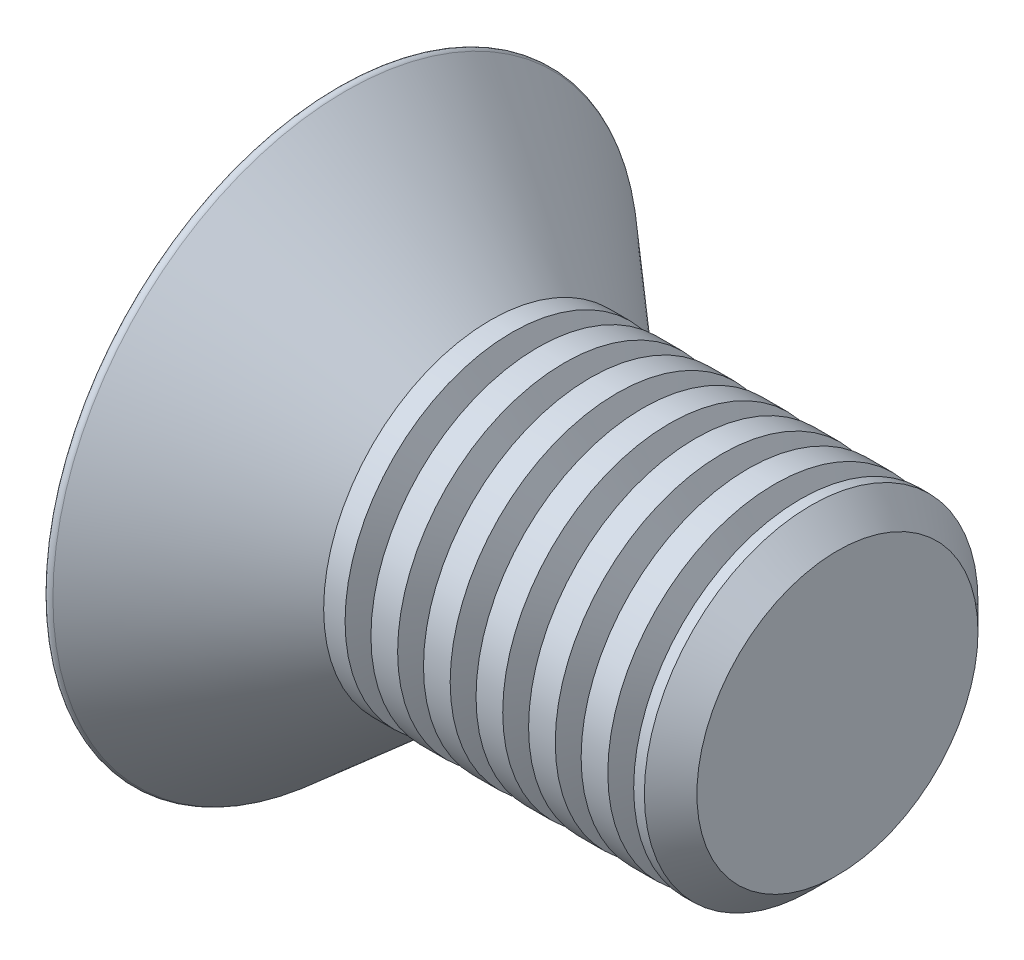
ISO-10303-21;
HEADER;
FILE_DESCRIPTION(('STEP AP214'),'2;1');
FILE_NAME('part.step','',(''),(''),'','','');
FILE_SCHEMA(('AUTOMOTIVE_DESIGN { 1 0 10303 214 1 1 1 1 }'));
ENDSEC;
DATA;
#1=APPLICATION_CONTEXT('core data for automotive mechanical design processes');
#2=APPLICATION_PROTOCOL_DEFINITION('international standard','automotive_design',2000,#1);
#3=PRODUCT_CONTEXT('',#1,'mechanical');
#4=PRODUCT('Part','Part','',(#3));
#5=PRODUCT_RELATED_PRODUCT_CATEGORY('part','',(#4));
#6=PRODUCT_DEFINITION_FORMATION('','',#4);
#7=PRODUCT_DEFINITION_CONTEXT('part definition',#1,'design');
#8=PRODUCT_DEFINITION('design','',#6,#7);
#9=PRODUCT_DEFINITION_SHAPE('','',#8);
#10=(LENGTH_UNIT() NAMED_UNIT(*) SI_UNIT(.MILLI.,.METRE.));
#11=(NAMED_UNIT(*) PLANE_ANGLE_UNIT() SI_UNIT($,.RADIAN.));
#12=(NAMED_UNIT(*) SI_UNIT($,.STERADIAN.) SOLID_ANGLE_UNIT());
#13=UNCERTAINTY_MEASURE_WITH_UNIT(LENGTH_MEASURE(1.E-05),#10,'distance_accuracy_value','');
#14=(GEOMETRIC_REPRESENTATION_CONTEXT(3) GLOBAL_UNCERTAINTY_ASSIGNED_CONTEXT((#13)) GLOBAL_UNIT_ASSIGNED_CONTEXT((#10,
#11,#12)) REPRESENTATION_CONTEXT('',''));
#15=CARTESIAN_POINT('',(0.,0.,0.));
#16=DIRECTION('',(0.,0.,1.));
#17=DIRECTION('',(1.,0.,0.));
#18=AXIS2_PLACEMENT_3D('',#15,#16,#17);
#19=CARTESIAN_POINT('',(-1.58750000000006,0.,0.));
#20=DIRECTION('',(-1.,0.,0.));
#21=DIRECTION('',(0.,0.,1.));
#22=AXIS2_PLACEMENT_3D('',#19,#20,#21);
#23=CYLINDRICAL_SURFACE('',#22,1.5875);
#24=CARTESIAN_POINT('',(-0.126532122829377,0.,0.));
#25=DIRECTION('',(-1.,0.,0.));
#26=DIRECTION('',(0.,0.,1.));
#27=AXIS2_PLACEMENT_3D('',#24,#25,#26);
#28=CIRCLE('',#27,1.5875);
#29=CARTESIAN_POINT('',(-0.126532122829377,0.,1.5875));
#30=VERTEX_POINT('',#29);
#31=EDGE_CURVE('E228',#30,#30,#28,.T.);
#32=ORIENTED_EDGE('',*,*,#31,.F.);
#33=EDGE_LOOP('',(#32));
#34=FACE_BOUND('',#33,.T.);
#35=CARTESIAN_POINT('',(0.0773169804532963,0.,0.));
#36=DIRECTION('',(-1.,0.,0.));
#37=DIRECTION('',(0.,0.,1.));
#38=AXIS2_PLACEMENT_3D('',#35,#36,#37);
#39=CIRCLE('',#38,1.5875);
#40=CARTESIAN_POINT('',(0.0773169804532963,0.,1.5875));
#41=VERTEX_POINT('',#40);
#42=EDGE_CURVE('E37',#41,#41,#39,.T.);
#43=ORIENTED_EDGE('',*,*,#42,.T.);
#44=EDGE_LOOP('',(#43));
#45=FACE_BOUND('',#44,.T.);
#46=ADVANCED_FACE('F33',(#34,#45),#23,.T.);
#47=CARTESIAN_POINT('',(-1.58750000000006,0.,0.));
#48=DIRECTION('',(-1.,0.,0.));
#49=DIRECTION('',(0.,0.,1.));
#50=AXIS2_PLACEMENT_3D('',#47,#48,#49);
#51=CONICAL_SURFACE('',#50,2.8575,0.715584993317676);
#52=CARTESIAN_POINT('',(-1.50469704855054,0.,0.));
#53=DIRECTION('',(1.,0.,0.));
#54=DIRECTION('',(0.,0.,-1.));
#55=AXIS2_PLACEMENT_3D('',#52,#53,#54);
#56=CIRCLE('',#55,2.78552049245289);
#57=CARTESIAN_POINT('',(-1.50469704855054,0.,-2.78552049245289));
#58=VERTEX_POINT('',#57);
#59=EDGE_CURVE('E248',#58,#58,#56,.T.);
#60=ORIENTED_EDGE('',*,*,#59,.T.);
#61=EDGE_LOOP('',(#60));
#62=FACE_BOUND('',#61,.T.);
#63=ORIENTED_EDGE('',*,*,#31,.T.);
#64=EDGE_LOOP('',(#63));
#65=FACE_BOUND('',#64,.T.);
#66=ADVANCED_FACE('F370',(#62,#65),#51,.T.);
#67=CARTESIAN_POINT('',(-1.58750000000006,-2.8575,0.));
#68=DIRECTION('',(-1.,0.,0.));
#69=DIRECTION('',(0.,0.,1.));
#70=AXIS2_PLACEMENT_3D('',#67,#68,#69);
#71=PLANE('',#70);
#72=DIRECTION('',(0.,0.,1.));
#73=VECTOR('',#72,1.);
#74=CARTESIAN_POINT('',(-1.58750000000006,-0.25,0.25));
#75=LINE('',#74,#73);
#76=CARTESIAN_POINT('',(-1.58750000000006,-0.25,0.75));
#77=VERTEX_POINT('',#76);
#78=CARTESIAN_POINT('',(-1.58750000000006,-0.25,1.85));
#79=VERTEX_POINT('',#78);
#80=EDGE_CURVE('E219',#77,#79,#75,.T.);
#81=ORIENTED_EDGE('',*,*,#80,.F.);
#82=CARTESIAN_POINT('',(-1.58750000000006,-0.75,0.75));
#83=DIRECTION('',(-1.,0.,0.));
#84=DIRECTION('',(0.,0.,1.));
#85=AXIS2_PLACEMENT_3D('',#82,#83,#84);
#86=CIRCLE('',#85,0.5);
#87=CARTESIAN_POINT('',(-1.58750000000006,-0.75,0.25));
#88=VERTEX_POINT('',#87);
#89=EDGE_CURVE('E260',#77,#88,#86,.T.);
#90=ORIENTED_EDGE('',*,*,#89,.T.);
#91=DIRECTION('',(0.,1.,0.));
#92=VECTOR('',#91,1.);
#93=CARTESIAN_POINT('',(-1.58750000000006,-1.85,0.25));
#94=LINE('',#93,#92);
#95=CARTESIAN_POINT('',(-1.58750000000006,-1.85,0.25));
#96=VERTEX_POINT('',#95);
#97=EDGE_CURVE('E216',#96,#88,#94,.T.);
#98=ORIENTED_EDGE('',*,*,#97,.F.);
#99=DIRECTION('',(0.,0.,1.));
#100=VECTOR('',#99,1.);
#101=CARTESIAN_POINT('',(-1.58750000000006,-1.85,-0.25));
#102=LINE('',#101,#100);
#103=CARTESIAN_POINT('',(-1.58750000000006,-1.85,-0.25));
#104=VERTEX_POINT('',#103);
#105=EDGE_CURVE('E213',#104,#96,#102,.T.);
#106=ORIENTED_EDGE('',*,*,#105,.F.);
#107=DIRECTION('',(0.,-1.,0.));
#108=VECTOR('',#107,1.);
#109=CARTESIAN_POINT('',(-1.58750000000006,-1.85,-0.25));
#110=LINE('',#109,#108);
#111=CARTESIAN_POINT('',(-1.58750000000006,-0.75,-0.25));
#112=VERTEX_POINT('',#111);
#113=EDGE_CURVE('E211',#112,#104,#110,.T.);
#114=ORIENTED_EDGE('',*,*,#113,.F.);
#115=CARTESIAN_POINT('',(-1.58750000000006,-0.75,-0.75));
#116=DIRECTION('',(-1.,0.,0.));
#117=DIRECTION('',(0.,0.,1.));
#118=AXIS2_PLACEMENT_3D('',#115,#116,#117);
#119=CIRCLE('',#118,0.5);
#120=CARTESIAN_POINT('',(-1.58750000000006,-0.25,-0.75));
#121=VERTEX_POINT('',#120);
#122=EDGE_CURVE('E258',#112,#121,#119,.T.);
#123=ORIENTED_EDGE('',*,*,#122,.T.);
#124=DIRECTION('',(0.,0.,1.));
#125=VECTOR('',#124,1.);
#126=CARTESIAN_POINT('',(-1.58750000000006,-0.25,-0.25));
#127=LINE('',#126,#125);
#128=CARTESIAN_POINT('',(-1.58750000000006,-0.25,-1.85));
#129=VERTEX_POINT('',#128);
#130=EDGE_CURVE('E208',#129,#121,#127,.T.);
#131=ORIENTED_EDGE('',*,*,#130,.F.);
#132=DIRECTION('',(0.,-1.,0.));
#133=VECTOR('',#132,1.);
#134=CARTESIAN_POINT('',(-1.58750000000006,0.25,-1.85));
#135=LINE('',#134,#133);
#136=CARTESIAN_POINT('',(-1.58750000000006,0.25,-1.85));
#137=VERTEX_POINT('',#136);
#138=EDGE_CURVE('E205',#137,#129,#135,.T.);
#139=ORIENTED_EDGE('',*,*,#138,.F.);
#140=DIRECTION('',(0.,0.,-1.));
#141=VECTOR('',#140,1.);
#142=CARTESIAN_POINT('',(-1.58750000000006,0.25,-0.25));
#143=LINE('',#142,#141);
#144=CARTESIAN_POINT('',(-1.58750000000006,0.25,-0.75));
#145=VERTEX_POINT('',#144);
#146=EDGE_CURVE('E203',#145,#137,#143,.T.);
#147=ORIENTED_EDGE('',*,*,#146,.F.);
#148=CARTESIAN_POINT('',(-1.58750000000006,0.75,-0.75));
#149=DIRECTION('',(-1.,0.,0.));
#150=DIRECTION('',(0.,0.,1.));
#151=AXIS2_PLACEMENT_3D('',#148,#149,#150);
#152=CIRCLE('',#151,0.5);
#153=CARTESIAN_POINT('',(-1.58750000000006,0.75,-0.25));
#154=VERTEX_POINT('',#153);
#155=EDGE_CURVE('E254',#145,#154,#152,.T.);
#156=ORIENTED_EDGE('',*,*,#155,.T.);
#157=DIRECTION('',(0.,-1.,0.));
#158=VECTOR('',#157,1.);
#159=CARTESIAN_POINT('',(-1.58750000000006,1.85,-0.25));
#160=LINE('',#159,#158);
#161=CARTESIAN_POINT('',(-1.58750000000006,1.85,-0.25));
#162=VERTEX_POINT('',#161);
#163=EDGE_CURVE('E201',#162,#154,#160,.T.);
#164=ORIENTED_EDGE('',*,*,#163,.F.);
#165=DIRECTION('',(0.,0.,-1.));
#166=VECTOR('',#165,1.);
#167=CARTESIAN_POINT('',(-1.58750000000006,1.85,0.25));
#168=LINE('',#167,#166);
#169=CARTESIAN_POINT('',(-1.58750000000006,1.85,0.25));
#170=VERTEX_POINT('',#169);
#171=EDGE_CURVE('E156',#170,#162,#168,.T.);
#172=ORIENTED_EDGE('',*,*,#171,.F.);
#173=DIRECTION('',(0.,1.,0.));
#174=VECTOR('',#173,1.);
#175=CARTESIAN_POINT('',(-1.58750000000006,1.85,0.25));
#176=LINE('',#175,#174);
#177=CARTESIAN_POINT('',(-1.58750000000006,0.75,0.25));
#178=VERTEX_POINT('',#177);
#179=EDGE_CURVE('E168',#178,#170,#176,.T.);
#180=ORIENTED_EDGE('',*,*,#179,.F.);
#181=CARTESIAN_POINT('',(-1.58750000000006,0.75,0.75));
#182=DIRECTION('',(-1.,0.,0.));
#183=DIRECTION('',(0.,0.,1.));
#184=AXIS2_PLACEMENT_3D('',#181,#182,#183);
#185=CIRCLE('',#184,0.5);
#186=CARTESIAN_POINT('',(-1.58750000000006,0.25,0.75));
#187=VERTEX_POINT('',#186);
#188=EDGE_CURVE('E256',#178,#187,#185,.T.);
#189=ORIENTED_EDGE('',*,*,#188,.T.);
#190=DIRECTION('',(0.,0.,-1.));
#191=VECTOR('',#190,1.);
#192=CARTESIAN_POINT('',(-1.58750000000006,0.25,0.25));
#193=LINE('',#192,#191);
#194=CARTESIAN_POINT('',(-1.58750000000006,0.25,1.85));
#195=VERTEX_POINT('',#194);
#196=EDGE_CURVE('E170',#195,#187,#193,.T.);
#197=ORIENTED_EDGE('',*,*,#196,.F.);
#198=DIRECTION('',(0.,1.,0.));
#199=VECTOR('',#198,1.);
#200=CARTESIAN_POINT('',(-1.58750000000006,-0.25,1.85));
#201=LINE('',#200,#199);
#202=EDGE_CURVE('E221',#79,#195,#201,.T.);
#203=ORIENTED_EDGE('',*,*,#202,.F.);
#204=EDGE_LOOP('',(#81,#90,#98,#106,#114,#123,#131,#139,#147,#156,#164,#172,#180,#189,#197,#203));
#205=FACE_BOUND('',#204,.T.);
#206=CARTESIAN_POINT('',(-1.58750000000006,0.,0.));
#207=DIRECTION('',(-1.,0.,0.));
#208=DIRECTION('',(0.,0.,1.));
#209=AXIS2_PLACEMENT_3D('',#206,#207,#208);
#210=CIRCLE('',#209,2.74778501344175);
#211=CARTESIAN_POINT('',(-1.58750000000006,0.,2.74778501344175));
#212=VERTEX_POINT('',#211);
#213=EDGE_CURVE('E245',#212,#212,#210,.T.);
#214=ORIENTED_EDGE('',*,*,#213,.T.);
#215=EDGE_LOOP('',(#214));
#216=FACE_BOUND('',#215,.T.);
#217=ADVANCED_FACE('F379',(#205,#216),#71,.T.);
#218=CARTESIAN_POINT('',(-1.53750000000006,0.,0.));
#219=DIRECTION('',(-1.,0.,0.));
#220=DIRECTION('',(0.,0.,1.));
#221=AXIS2_PLACEMENT_3D('',#218,#219,#220);
#222=TOROIDAL_SURFACE('',#221,2.74778501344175,0.05);
#223=ORIENTED_EDGE('',*,*,#59,.F.);
#224=EDGE_LOOP('',(#223));
#225=FACE_BOUND('',#224,.T.);
#226=ORIENTED_EDGE('',*,*,#213,.F.);
#227=EDGE_LOOP('',(#226));
#228=FACE_BOUND('',#227,.T.);
#229=ADVANCED_FACE('F711',(#225,#228),#222,.T.);
#230=CARTESIAN_POINT('',(-1.08750000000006,1.85,0.25));
#231=DIRECTION('',(0.,1.,0.));
#232=DIRECTION('',(0.,0.,1.));
#233=AXIS2_PLACEMENT_3D('',#230,#231,#232);
#234=PLANE('',#233);
#235=ORIENTED_EDGE('',*,*,#171,.T.);
#236=DIRECTION('',(-1.,0.,0.));
#237=VECTOR('',#236,1.);
#238=CARTESIAN_POINT('',(-1.08750000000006,1.85,-0.25));
#239=LINE('',#238,#237);
#240=CARTESIAN_POINT('',(-1.08750000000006,1.85,-0.25));
#241=VERTEX_POINT('',#240);
#242=EDGE_CURVE('E150',#241,#162,#239,.T.);
#243=ORIENTED_EDGE('',*,*,#242,.F.);
#244=DIRECTION('',(0.,0.,-1.));
#245=VECTOR('',#244,1.);
#246=CARTESIAN_POINT('',(-1.08750000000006,1.85,0.25));
#247=LINE('',#246,#245);
#248=CARTESIAN_POINT('',(-1.08750000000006,1.85,0.25));
#249=VERTEX_POINT('',#248);
#250=EDGE_CURVE('E154',#249,#241,#247,.T.);
#251=ORIENTED_EDGE('',*,*,#250,.F.);
#252=DIRECTION('',(-1.,0.,0.));
#253=VECTOR('',#252,1.);
#254=CARTESIAN_POINT('',(-1.08750000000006,1.85,0.25));
#255=LINE('',#254,#253);
#256=EDGE_CURVE('E226',#249,#170,#255,.T.);
#257=ORIENTED_EDGE('',*,*,#256,.T.);
#258=EDGE_LOOP('',(#235,#243,#251,#257));
#259=FACE_BOUND('',#258,.T.);
#260=ADVANCED_FACE('F151',(#259),#234,.F.);
#261=CARTESIAN_POINT('',(-1.08750000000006,1.85,0.25));
#262=DIRECTION('',(0.,0.,1.));
#263=DIRECTION('',(0.,-1.,0.));
#264=AXIS2_PLACEMENT_3D('',#261,#262,#263);
#265=PLANE('',#264);
#266=DIRECTION('',(0.,1.,0.));
#267=VECTOR('',#266,1.);
#268=CARTESIAN_POINT('',(-1.08750000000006,1.85,0.25));
#269=LINE('',#268,#267);
#270=CARTESIAN_POINT('',(-1.08750000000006,0.75,0.25));
#271=VERTEX_POINT('',#270);
#272=EDGE_CURVE('E159',#271,#249,#269,.T.);
#273=ORIENTED_EDGE('',*,*,#272,.F.);
#274=DIRECTION('',(-1.,0.,0.));
#275=VECTOR('',#274,1.);
#276=CARTESIAN_POINT('',(-1.08750000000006,0.75,0.25));
#277=LINE('',#276,#275);
#278=EDGE_CURVE('E269',#271,#178,#277,.T.);
#279=ORIENTED_EDGE('',*,*,#278,.T.);
#280=ORIENTED_EDGE('',*,*,#179,.T.);
#281=ORIENTED_EDGE('',*,*,#256,.F.);
#282=EDGE_LOOP('',(#273,#279,#280,#281));
#283=FACE_BOUND('',#282,.T.);
#284=ADVANCED_FACE('F695',(#283),#265,.F.);
#285=CARTESIAN_POINT('',(-1.08750000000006,0.25,0.25));
#286=DIRECTION('',(0.,1.,0.));
#287=DIRECTION('',(0.,0.,1.));
#288=AXIS2_PLACEMENT_3D('',#285,#286,#287);
#289=PLANE('',#288);
#290=ORIENTED_EDGE('',*,*,#196,.T.);
#291=DIRECTION('',(-1.,0.,0.));
#292=VECTOR('',#291,1.);
#293=CARTESIAN_POINT('',(-1.08750000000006,0.25,0.75));
#294=LINE('',#293,#292);
#295=CARTESIAN_POINT('',(-1.08750000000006,0.25,0.75));
#296=VERTEX_POINT('',#295);
#297=EDGE_CURVE('E272',#187,#296,#294,.F.);
#298=ORIENTED_EDGE('',*,*,#297,.T.);
#299=DIRECTION('',(0.,0.,-1.));
#300=VECTOR('',#299,1.);
#301=CARTESIAN_POINT('',(-1.08750000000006,0.25,0.25));
#302=LINE('',#301,#300);
#303=CARTESIAN_POINT('',(-1.08750000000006,0.25,1.85));
#304=VERTEX_POINT('',#303);
#305=EDGE_CURVE('E196',#304,#296,#302,.T.);
#306=ORIENTED_EDGE('',*,*,#305,.F.);
#307=DIRECTION('',(-1.,0.,0.));
#308=VECTOR('',#307,1.);
#309=CARTESIAN_POINT('',(-1.08750000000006,0.25,1.85));
#310=LINE('',#309,#308);
#311=EDGE_CURVE('E229',#304,#195,#310,.T.);
#312=ORIENTED_EDGE('',*,*,#311,.T.);
#313=EDGE_LOOP('',(#290,#298,#306,#312));
#314=FACE_BOUND('',#313,.T.);
#315=ADVANCED_FACE('F686',(#314),#289,.F.);
#316=CARTESIAN_POINT('',(-1.08750000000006,-0.25,1.85));
#317=DIRECTION('',(0.,0.,1.));
#318=DIRECTION('',(1.,0.,0.));
#319=AXIS2_PLACEMENT_3D('',#316,#317,#318);
#320=PLANE('',#319);
#321=ORIENTED_EDGE('',*,*,#202,.T.);
#322=ORIENTED_EDGE('',*,*,#311,.F.);
#323=DIRECTION('',(0.,1.,0.));
#324=VECTOR('',#323,1.);
#325=CARTESIAN_POINT('',(-1.08750000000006,-0.25,1.85));
#326=LINE('',#325,#324);
#327=CARTESIAN_POINT('',(-1.08750000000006,-0.25,1.85));
#328=VERTEX_POINT('',#327);
#329=EDGE_CURVE('E193',#328,#304,#326,.T.);
#330=ORIENTED_EDGE('',*,*,#329,.F.);
#331=DIRECTION('',(-1.,0.,0.));
#332=VECTOR('',#331,1.);
#333=CARTESIAN_POINT('',(-1.08750000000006,-0.25,1.85));
#334=LINE('',#333,#332);
#335=EDGE_CURVE('E231',#328,#79,#334,.T.);
#336=ORIENTED_EDGE('',*,*,#335,.T.);
#337=EDGE_LOOP('',(#321,#322,#330,#336));
#338=FACE_BOUND('',#337,.T.);
#339=ADVANCED_FACE('F677',(#338),#320,.F.);
#340=CARTESIAN_POINT('',(-1.08750000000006,-0.25,0.25));
#341=DIRECTION('',(0.,-1.,0.));
#342=DIRECTION('',(0.,0.,-1.));
#343=AXIS2_PLACEMENT_3D('',#340,#341,#342);
#344=PLANE('',#343);
#345=DIRECTION('',(0.,0.,1.));
#346=VECTOR('',#345,1.);
#347=CARTESIAN_POINT('',(-1.08750000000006,-0.25,0.25));
#348=LINE('',#347,#346);
#349=CARTESIAN_POINT('',(-1.08750000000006,-0.25,0.75));
#350=VERTEX_POINT('',#349);
#351=EDGE_CURVE('E191',#350,#328,#348,.T.);
#352=ORIENTED_EDGE('',*,*,#351,.F.);
#353=DIRECTION('',(-1.,0.,0.));
#354=VECTOR('',#353,1.);
#355=CARTESIAN_POINT('',(-1.08750000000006,-0.25,0.75));
#356=LINE('',#355,#354);
#357=EDGE_CURVE('E251',#350,#77,#356,.T.);
#358=ORIENTED_EDGE('',*,*,#357,.T.);
#359=ORIENTED_EDGE('',*,*,#80,.T.);
#360=ORIENTED_EDGE('',*,*,#335,.F.);
#361=EDGE_LOOP('',(#352,#358,#359,#360));
#362=FACE_BOUND('',#361,.T.);
#363=ADVANCED_FACE('F668',(#362),#344,.F.);
#364=CARTESIAN_POINT('',(-1.08750000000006,-1.85,0.25));
#365=DIRECTION('',(0.,0.,1.));
#366=DIRECTION('',(0.,-1.,0.));
#367=AXIS2_PLACEMENT_3D('',#364,#365,#366);
#368=PLANE('',#367);
#369=ORIENTED_EDGE('',*,*,#97,.T.);
#370=DIRECTION('',(-1.,0.,0.));
#371=VECTOR('',#370,1.);
#372=CARTESIAN_POINT('',(-1.08750000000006,-0.75,0.25));
#373=LINE('',#372,#371);
#374=CARTESIAN_POINT('',(-1.08750000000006,-0.75,0.25));
#375=VERTEX_POINT('',#374);
#376=EDGE_CURVE('E262',#88,#375,#373,.F.);
#377=ORIENTED_EDGE('',*,*,#376,.T.);
#378=DIRECTION('',(0.,1.,0.));
#379=VECTOR('',#378,1.);
#380=CARTESIAN_POINT('',(-1.08750000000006,-1.85,0.25));
#381=LINE('',#380,#379);
#382=CARTESIAN_POINT('',(-1.08750000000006,-1.85,0.25));
#383=VERTEX_POINT('',#382);
#384=EDGE_CURVE('E188',#383,#375,#381,.T.);
#385=ORIENTED_EDGE('',*,*,#384,.F.);
#386=DIRECTION('',(-1.,0.,0.));
#387=VECTOR('',#386,1.);
#388=CARTESIAN_POINT('',(-1.08750000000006,-1.85,0.25));
#389=LINE('',#388,#387);
#390=EDGE_CURVE('E234',#383,#96,#389,.T.);
#391=ORIENTED_EDGE('',*,*,#390,.T.);
#392=EDGE_LOOP('',(#369,#377,#385,#391));
#393=FACE_BOUND('',#392,.T.);
#394=ADVANCED_FACE('F659',(#393),#368,.F.);
#395=CARTESIAN_POINT('',(-1.08750000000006,-1.85,-0.25));
#396=DIRECTION('',(0.,-1.,0.));
#397=DIRECTION('',(0.,0.,-1.));
#398=AXIS2_PLACEMENT_3D('',#395,#396,#397);
#399=PLANE('',#398);
#400=ORIENTED_EDGE('',*,*,#105,.T.);
#401=ORIENTED_EDGE('',*,*,#390,.F.);
#402=DIRECTION('',(0.,0.,1.));
#403=VECTOR('',#402,1.);
#404=CARTESIAN_POINT('',(-1.08750000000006,-1.85,-0.25));
#405=LINE('',#404,#403);
#406=CARTESIAN_POINT('',(-1.08750000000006,-1.85,-0.25));
#407=VERTEX_POINT('',#406);
#408=EDGE_CURVE('E185',#407,#383,#405,.T.);
#409=ORIENTED_EDGE('',*,*,#408,.F.);
#410=DIRECTION('',(-1.,0.,0.));
#411=VECTOR('',#410,1.);
#412=CARTESIAN_POINT('',(-1.08750000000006,-1.85,-0.25));
#413=LINE('',#412,#411);
#414=EDGE_CURVE('E236',#407,#104,#413,.T.);
#415=ORIENTED_EDGE('',*,*,#414,.T.);
#416=EDGE_LOOP('',(#400,#401,#409,#415));
#417=FACE_BOUND('',#416,.T.);
#418=ADVANCED_FACE('F650',(#417),#399,.F.);
#419=CARTESIAN_POINT('',(-1.08750000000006,-1.85,-0.25));
#420=DIRECTION('',(0.,0.,-1.));
#421=DIRECTION('',(0.,1.,0.));
#422=AXIS2_PLACEMENT_3D('',#419,#420,#421);
#423=PLANE('',#422);
#424=DIRECTION('',(0.,-1.,0.));
#425=VECTOR('',#424,1.);
#426=CARTESIAN_POINT('',(-1.08750000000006,-1.85,-0.25));
#427=LINE('',#426,#425);
#428=CARTESIAN_POINT('',(-1.08750000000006,-0.75,-0.25));
#429=VERTEX_POINT('',#428);
#430=EDGE_CURVE('E183',#429,#407,#427,.T.);
#431=ORIENTED_EDGE('',*,*,#430,.F.);
#432=DIRECTION('',(-1.,0.,0.));
#433=VECTOR('',#432,1.);
#434=CARTESIAN_POINT('',(-1.08750000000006,-0.75,-0.25));
#435=LINE('',#434,#433);
#436=EDGE_CURVE('E264',#429,#112,#435,.T.);
#437=ORIENTED_EDGE('',*,*,#436,.T.);
#438=ORIENTED_EDGE('',*,*,#113,.T.);
#439=ORIENTED_EDGE('',*,*,#414,.F.);
#440=EDGE_LOOP('',(#431,#437,#438,#439));
#441=FACE_BOUND('',#440,.T.);
#442=ADVANCED_FACE('F641',(#441),#423,.F.);
#443=CARTESIAN_POINT('',(-1.08750000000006,-0.25,-0.25));
#444=DIRECTION('',(0.,-1.,0.));
#445=DIRECTION('',(0.,0.,-1.));
#446=AXIS2_PLACEMENT_3D('',#443,#444,#445);
#447=PLANE('',#446);
#448=ORIENTED_EDGE('',*,*,#130,.T.);
#449=DIRECTION('',(-1.,0.,0.));
#450=VECTOR('',#449,1.);
#451=CARTESIAN_POINT('',(-1.08750000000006,-0.25,-0.75));
#452=LINE('',#451,#450);
#453=CARTESIAN_POINT('',(-1.08750000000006,-0.25,-0.75));
#454=VERTEX_POINT('',#453);
#455=EDGE_CURVE('E267',#121,#454,#452,.F.);
#456=ORIENTED_EDGE('',*,*,#455,.T.);
#457=DIRECTION('',(0.,0.,1.));
#458=VECTOR('',#457,1.);
#459=CARTESIAN_POINT('',(-1.08750000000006,-0.25,-0.25));
#460=LINE('',#459,#458);
#461=CARTESIAN_POINT('',(-1.08750000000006,-0.25,-1.85));
#462=VERTEX_POINT('',#461);
#463=EDGE_CURVE('E180',#462,#454,#460,.T.);
#464=ORIENTED_EDGE('',*,*,#463,.F.);
#465=DIRECTION('',(-1.,0.,0.));
#466=VECTOR('',#465,1.);
#467=CARTESIAN_POINT('',(-1.08750000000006,-0.25,-1.85));
#468=LINE('',#467,#466);
#469=EDGE_CURVE('E239',#462,#129,#468,.T.);
#470=ORIENTED_EDGE('',*,*,#469,.T.);
#471=EDGE_LOOP('',(#448,#456,#464,#470));
#472=FACE_BOUND('',#471,.T.);
#473=ADVANCED_FACE('F631',(#472),#447,.F.);
#474=CARTESIAN_POINT('',(-1.08750000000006,0.25,-1.85));
#475=DIRECTION('',(0.,0.,-1.));
#476=DIRECTION('',(-1.,0.,0.));
#477=AXIS2_PLACEMENT_3D('',#474,#475,#476);
#478=PLANE('',#477);
#479=ORIENTED_EDGE('',*,*,#138,.T.);
#480=ORIENTED_EDGE('',*,*,#469,.F.);
#481=DIRECTION('',(0.,-1.,0.));
#482=VECTOR('',#481,1.);
#483=CARTESIAN_POINT('',(-1.08750000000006,0.25,-1.85));
#484=LINE('',#483,#482);
#485=CARTESIAN_POINT('',(-1.08750000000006,0.25,-1.85));
#486=VERTEX_POINT('',#485);
#487=EDGE_CURVE('E177',#486,#462,#484,.T.);
#488=ORIENTED_EDGE('',*,*,#487,.F.);
#489=DIRECTION('',(-1.,0.,0.));
#490=VECTOR('',#489,1.);
#491=CARTESIAN_POINT('',(-1.08750000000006,0.25,-1.85));
#492=LINE('',#491,#490);
#493=EDGE_CURVE('E158',#486,#137,#492,.T.);
#494=ORIENTED_EDGE('',*,*,#493,.T.);
#495=EDGE_LOOP('',(#479,#480,#488,#494));
#496=FACE_BOUND('',#495,.T.);
#497=ADVANCED_FACE('F621',(#496),#478,.F.);
#498=CARTESIAN_POINT('',(-1.08750000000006,0.25,-0.25));
#499=DIRECTION('',(0.,1.,0.));
#500=DIRECTION('',(0.,0.,1.));
#501=AXIS2_PLACEMENT_3D('',#498,#499,#500);
#502=PLANE('',#501);
#503=DIRECTION('',(0.,0.,-1.));
#504=VECTOR('',#503,1.);
#505=CARTESIAN_POINT('',(-1.08750000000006,0.25,-0.25));
#506=LINE('',#505,#504);
#507=CARTESIAN_POINT('',(-1.08750000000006,0.25,-0.75));
#508=VERTEX_POINT('',#507);
#509=EDGE_CURVE('E163',#508,#486,#506,.T.);
#510=ORIENTED_EDGE('',*,*,#509,.F.);
#511=DIRECTION('',(-1.,0.,0.));
#512=VECTOR('',#511,1.);
#513=CARTESIAN_POINT('',(-1.08750000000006,0.25,-0.75));
#514=LINE('',#513,#512);
#515=EDGE_CURVE('E274',#508,#145,#514,.T.);
#516=ORIENTED_EDGE('',*,*,#515,.T.);
#517=ORIENTED_EDGE('',*,*,#146,.T.);
#518=ORIENTED_EDGE('',*,*,#493,.F.);
#519=EDGE_LOOP('',(#510,#516,#517,#518));
#520=FACE_BOUND('',#519,.T.);
#521=ADVANCED_FACE('F613',(#520),#502,.F.);
#522=CARTESIAN_POINT('',(-1.08750000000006,1.85,-0.25));
#523=DIRECTION('',(0.,0.,-1.));
#524=DIRECTION('',(0.,1.,0.));
#525=AXIS2_PLACEMENT_3D('',#522,#523,#524);
#526=PLANE('',#525);
#527=ORIENTED_EDGE('',*,*,#163,.T.);
#528=DIRECTION('',(-1.,0.,0.));
#529=VECTOR('',#528,1.);
#530=CARTESIAN_POINT('',(-1.08750000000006,0.75,-0.25));
#531=LINE('',#530,#529);
#532=CARTESIAN_POINT('',(-1.08750000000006,0.75,-0.25));
#533=VERTEX_POINT('',#532);
#534=EDGE_CURVE('E50',#154,#533,#531,.F.);
#535=ORIENTED_EDGE('',*,*,#534,.T.);
#536=DIRECTION('',(0.,-1.,0.));
#537=VECTOR('',#536,1.);
#538=CARTESIAN_POINT('',(-1.08750000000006,1.85,-0.25));
#539=LINE('',#538,#537);
#540=EDGE_CURVE('E161',#241,#533,#539,.T.);
#541=ORIENTED_EDGE('',*,*,#540,.F.);
#542=ORIENTED_EDGE('',*,*,#242,.T.);
#543=EDGE_LOOP('',(#527,#535,#541,#542));
#544=FACE_BOUND('',#543,.T.);
#545=ADVANCED_FACE('F162',(#544),#526,.F.);
#546=CARTESIAN_POINT('',(-1.08750000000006,0.,0.));
#547=DIRECTION('',(-1.,0.,0.));
#548=DIRECTION('',(0.,0.,1.));
#549=AXIS2_PLACEMENT_3D('',#546,#547,#548);
#550=PLANE('',#549);
#551=ORIENTED_EDGE('',*,*,#250,.T.);
#552=ORIENTED_EDGE('',*,*,#540,.T.);
#553=CARTESIAN_POINT('',(-1.08750000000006,0.75,-0.75));
#554=DIRECTION('',(-1.,0.,0.));
#555=DIRECTION('',(0.,0.,1.));
#556=AXIS2_PLACEMENT_3D('',#553,#554,#555);
#557=CIRCLE('',#556,0.5);
#558=EDGE_CURVE('E57',#533,#508,#557,.F.);
#559=ORIENTED_EDGE('',*,*,#558,.T.);
#560=ORIENTED_EDGE('',*,*,#509,.T.);
#561=ORIENTED_EDGE('',*,*,#487,.T.);
#562=ORIENTED_EDGE('',*,*,#463,.T.);
#563=CARTESIAN_POINT('',(-1.08750000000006,-0.75,-0.75));
#564=DIRECTION('',(-1.,0.,0.));
#565=DIRECTION('',(0.,0.,1.));
#566=AXIS2_PLACEMENT_3D('',#563,#564,#565);
#567=CIRCLE('',#566,0.5);
#568=EDGE_CURVE('E280',#454,#429,#567,.F.);
#569=ORIENTED_EDGE('',*,*,#568,.T.);
#570=ORIENTED_EDGE('',*,*,#430,.T.);
#571=ORIENTED_EDGE('',*,*,#408,.T.);
#572=ORIENTED_EDGE('',*,*,#384,.T.);
#573=CARTESIAN_POINT('',(-1.08750000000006,-0.75,0.75));
#574=DIRECTION('',(-1.,0.,0.));
#575=DIRECTION('',(0.,0.,1.));
#576=AXIS2_PLACEMENT_3D('',#573,#574,#575);
#577=CIRCLE('',#576,0.5);
#578=EDGE_CURVE('E278',#375,#350,#577,.F.);
#579=ORIENTED_EDGE('',*,*,#578,.T.);
#580=ORIENTED_EDGE('',*,*,#351,.T.);
#581=ORIENTED_EDGE('',*,*,#329,.T.);
#582=ORIENTED_EDGE('',*,*,#305,.T.);
#583=CARTESIAN_POINT('',(-1.08750000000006,0.75,0.75));
#584=DIRECTION('',(-1.,0.,0.));
#585=DIRECTION('',(0.,0.,1.));
#586=AXIS2_PLACEMENT_3D('',#583,#584,#585);
#587=CIRCLE('',#586,0.5);
#588=EDGE_CURVE('E282',#296,#271,#587,.F.);
#589=ORIENTED_EDGE('',*,*,#588,.T.);
#590=ORIENTED_EDGE('',*,*,#272,.T.);
#591=EDGE_LOOP('',(#551,#552,#559,#560,#561,#562,#569,#570,#571,#572,#579,#580,#581,#582,#589,#590));
#592=FACE_BOUND('',#591,.T.);
#593=ADVANCED_FACE('F165',(#592),#550,.T.);
#594=CARTESIAN_POINT('',(-1.08750000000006,-0.75,0.75));
#595=DIRECTION('',(-1.,0.,0.));
#596=DIRECTION('',(0.,0.,1.));
#597=AXIS2_PLACEMENT_3D('',#594,#595,#596);
#598=CYLINDRICAL_SURFACE('',#597,0.5);
#599=ORIENTED_EDGE('',*,*,#578,.F.);
#600=ORIENTED_EDGE('',*,*,#376,.F.);
#601=ORIENTED_EDGE('',*,*,#89,.F.);
#602=ORIENTED_EDGE('',*,*,#357,.F.);
#603=EDGE_LOOP('',(#599,#600,#601,#602));
#604=FACE_BOUND('',#603,.T.);
#605=ADVANCED_FACE('F589',(#604),#598,.T.);
#606=CARTESIAN_POINT('',(-1.08750000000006,-0.75,-0.75));
#607=DIRECTION('',(-1.,0.,0.));
#608=DIRECTION('',(0.,0.,1.));
#609=AXIS2_PLACEMENT_3D('',#606,#607,#608);
#610=CYLINDRICAL_SURFACE('',#609,0.5);
#611=ORIENTED_EDGE('',*,*,#568,.F.);
#612=ORIENTED_EDGE('',*,*,#455,.F.);
#613=ORIENTED_EDGE('',*,*,#122,.F.);
#614=ORIENTED_EDGE('',*,*,#436,.F.);
#615=EDGE_LOOP('',(#611,#612,#613,#614));
#616=FACE_BOUND('',#615,.T.);
#617=ADVANCED_FACE('F580',(#616),#610,.T.);
#618=CARTESIAN_POINT('',(-1.08750000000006,0.75,0.75));
#619=DIRECTION('',(-1.,0.,0.));
#620=DIRECTION('',(0.,0.,1.));
#621=AXIS2_PLACEMENT_3D('',#618,#619,#620);
#622=CYLINDRICAL_SURFACE('',#621,0.5);
#623=ORIENTED_EDGE('',*,*,#588,.F.);
#624=ORIENTED_EDGE('',*,*,#297,.F.);
#625=ORIENTED_EDGE('',*,*,#188,.F.);
#626=ORIENTED_EDGE('',*,*,#278,.F.);
#627=EDGE_LOOP('',(#623,#624,#625,#626));
#628=FACE_BOUND('',#627,.T.);
#629=ADVANCED_FACE('F572',(#628),#622,.T.);
#630=CARTESIAN_POINT('',(-1.08750000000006,0.75,-0.75));
#631=DIRECTION('',(-1.,0.,0.));
#632=DIRECTION('',(0.,0.,1.));
#633=AXIS2_PLACEMENT_3D('',#630,#631,#632);
#634=CYLINDRICAL_SURFACE('',#633,0.5);
#635=ORIENTED_EDGE('',*,*,#558,.F.);
#636=ORIENTED_EDGE('',*,*,#534,.F.);
#637=ORIENTED_EDGE('',*,*,#155,.F.);
#638=ORIENTED_EDGE('',*,*,#515,.F.);
#639=EDGE_LOOP('',(#635,#636,#637,#638));
#640=FACE_BOUND('',#639,.T.);
#641=ADVANCED_FACE('F329',(#640),#634,.T.);
#642=CARTESIAN_POINT('',(0.0109530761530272,0.,0.));
#643=DIRECTION('',(-1.,0.,0.));
#644=DIRECTION('',(0.,0.,1.));
#645=AXIS2_PLACEMENT_3D('',#642,#643,#644);
#646=CONICAL_SURFACE('',#645,1.73570137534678,1.14977720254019);
#647=ORIENTED_EDGE('',*,*,#42,.F.);
#648=EDGE_LOOP('',(#647));
#649=FACE_BOUND('',#648,.T.);
#650=CARTESIAN_POINT('',(0.200372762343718,0.,0.));
#651=DIRECTION('',(-1.,0.,0.));
#652=DIRECTION('',(0.,0.,1.));
#653=AXIS2_PLACEMENT_3D('',#650,#651,#652);
#654=CIRCLE('',#653,1.31269645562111);
#655=CARTESIAN_POINT('',(0.200372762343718,0.,1.31269645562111));
#656=VERTEX_POINT('',#655);
#657=EDGE_CURVE('E291',#656,#656,#654,.T.);
#658=ORIENTED_EDGE('',*,*,#657,.T.);
#659=EDGE_LOOP('',(#658));
#660=FACE_BOUND('',#659,.T.);
#661=ADVANCED_FACE('F325',(#649,#660),#646,.T.);
#662=CARTESIAN_POINT('',(0.200372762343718,0.,0.));
#663=DIRECTION('',(1.,0.,0.));
#664=DIRECTION('',(0.,0.,-1.));
#665=AXIS2_PLACEMENT_3D('',#662,#663,#664);
#666=CONICAL_SURFACE('',#665,1.31269645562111,1.14977720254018);
#667=CARTESIAN_POINT('',(0.323428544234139,0.,0.));
#668=DIRECTION('',(1.,0.,0.));
#669=DIRECTION('',(0.,0.,-1.));
#670=AXIS2_PLACEMENT_3D('',#667,#668,#669);
#671=CIRCLE('',#670,1.5875);
#672=CARTESIAN_POINT('',(0.323428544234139,0.,-1.5875));
#673=VERTEX_POINT('',#672);
#674=EDGE_CURVE('E317',#673,#673,#671,.T.);
#675=ORIENTED_EDGE('',*,*,#674,.F.);
#676=EDGE_LOOP('',(#675));
#677=FACE_BOUND('',#676,.T.);
#678=ORIENTED_EDGE('',*,*,#657,.F.);
#679=EDGE_LOOP('',(#678));
#680=FACE_BOUND('',#679,.T.);
#681=ADVANCED_FACE('F328',(#677,#680),#666,.T.);
#682=CARTESIAN_POINT('',(0.577316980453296,0.,0.));
#683=DIRECTION('',(-1.,0.,0.));
#684=DIRECTION('',(0.,0.,1.));
#685=AXIS2_PLACEMENT_3D('',#682,#683,#684);
#686=CIRCLE('',#685,1.5875);
#687=CARTESIAN_POINT('',(0.577316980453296,0.,1.5875));
#688=VERTEX_POINT('',#687);
#689=EDGE_CURVE('E315',#688,#688,#686,.T.);
#690=ORIENTED_EDGE('',*,*,#689,.T.);
#691=EDGE_LOOP('',(#690));
#692=FACE_BOUND('',#691,.T.);
#693=ORIENTED_EDGE('',*,*,#674,.T.);
#694=EDGE_LOOP('',(#693));
#695=FACE_BOUND('',#694,.T.);
#696=ADVANCED_FACE('F373',(#692,#695),#23,.T.);
#697=CARTESIAN_POINT('',(0.510953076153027,0.,0.));
#698=DIRECTION('',(-1.,0.,0.));
#699=DIRECTION('',(0.,0.,1.));
#700=AXIS2_PLACEMENT_3D('',#697,#698,#699);
#701=CONICAL_SURFACE('',#700,1.73570137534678,1.14977720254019);
#702=ORIENTED_EDGE('',*,*,#689,.F.);
#703=EDGE_LOOP('',(#702));
#704=FACE_BOUND('',#703,.T.);
#705=CARTESIAN_POINT('',(0.700372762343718,0.,0.));
#706=DIRECTION('',(-1.,0.,0.));
#707=DIRECTION('',(0.,0.,1.));
#708=AXIS2_PLACEMENT_3D('',#705,#706,#707);
#709=CIRCLE('',#708,1.31269645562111);
#710=CARTESIAN_POINT('',(0.700372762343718,0.,1.31269645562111));
#711=VERTEX_POINT('',#710);
#712=EDGE_CURVE('E334',#711,#711,#709,.T.);
#713=ORIENTED_EDGE('',*,*,#712,.T.);
#714=EDGE_LOOP('',(#713));
#715=FACE_BOUND('',#714,.T.);
#716=ADVANCED_FACE('F385',(#704,#715),#701,.T.);
#717=CARTESIAN_POINT('',(0.700372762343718,0.,0.));
#718=DIRECTION('',(1.,0.,0.));
#719=DIRECTION('',(0.,0.,-1.));
#720=AXIS2_PLACEMENT_3D('',#717,#718,#719);
#721=CONICAL_SURFACE('',#720,1.31269645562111,1.14977720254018);
#722=CARTESIAN_POINT('',(0.823428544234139,0.,0.));
#723=DIRECTION('',(1.,0.,0.));
#724=DIRECTION('',(0.,0.,-1.));
#725=AXIS2_PLACEMENT_3D('',#722,#723,#724);
#726=CIRCLE('',#725,1.5875);
#727=CARTESIAN_POINT('',(0.823428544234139,0.,-1.5875));
#728=VERTEX_POINT('',#727);
#729=EDGE_CURVE('E312',#728,#728,#726,.T.);
#730=ORIENTED_EDGE('',*,*,#729,.F.);
#731=EDGE_LOOP('',(#730));
#732=FACE_BOUND('',#731,.T.);
#733=ORIENTED_EDGE('',*,*,#712,.F.);
#734=EDGE_LOOP('',(#733));
#735=FACE_BOUND('',#734,.T.);
#736=ADVANCED_FACE('F433',(#732,#735),#721,.T.);
#737=CARTESIAN_POINT('',(1.0773169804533,0.,0.));
#738=DIRECTION('',(-1.,0.,0.));
#739=DIRECTION('',(0.,0.,1.));
#740=AXIS2_PLACEMENT_3D('',#737,#738,#739);
#741=CIRCLE('',#740,1.5875);
#742=CARTESIAN_POINT('',(1.0773169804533,0.,1.5875));
#743=VERTEX_POINT('',#742);
#744=EDGE_CURVE('E309',#743,#743,#741,.T.);
#745=ORIENTED_EDGE('',*,*,#744,.T.);
#746=EDGE_LOOP('',(#745));
#747=FACE_BOUND('',#746,.T.);
#748=ORIENTED_EDGE('',*,*,#729,.T.);
#749=EDGE_LOOP('',(#748));
#750=FACE_BOUND('',#749,.T.);
#751=ADVANCED_FACE('F387',(#747,#750),#23,.T.);
#752=CARTESIAN_POINT('',(1.01095307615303,0.,0.));
#753=DIRECTION('',(-1.,0.,0.));
#754=DIRECTION('',(0.,0.,1.));
#755=AXIS2_PLACEMENT_3D('',#752,#753,#754);
#756=CONICAL_SURFACE('',#755,1.73570137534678,1.14977720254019);
#757=ORIENTED_EDGE('',*,*,#744,.F.);
#758=EDGE_LOOP('',(#757));
#759=FACE_BOUND('',#758,.T.);
#760=CARTESIAN_POINT('',(1.20037276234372,0.,0.));
#761=DIRECTION('',(-1.,0.,0.));
#762=DIRECTION('',(0.,0.,1.));
#763=AXIS2_PLACEMENT_3D('',#760,#761,#762);
#764=CIRCLE('',#763,1.31269645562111);
#765=CARTESIAN_POINT('',(1.20037276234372,0.,1.31269645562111));
#766=VERTEX_POINT('',#765);
#767=EDGE_CURVE('E337',#766,#766,#764,.T.);
#768=ORIENTED_EDGE('',*,*,#767,.T.);
#769=EDGE_LOOP('',(#768));
#770=FACE_BOUND('',#769,.T.);
#771=ADVANCED_FACE('F428',(#759,#770),#756,.T.);
#772=CARTESIAN_POINT('',(1.20037276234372,0.,0.));
#773=DIRECTION('',(1.,0.,0.));
#774=DIRECTION('',(0.,0.,-1.));
#775=AXIS2_PLACEMENT_3D('',#772,#773,#774);
#776=CONICAL_SURFACE('',#775,1.31269645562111,1.14977720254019);
#777=CARTESIAN_POINT('',(1.32342854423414,0.,0.));
#778=DIRECTION('',(1.,0.,0.));
#779=DIRECTION('',(0.,0.,-1.));
#780=AXIS2_PLACEMENT_3D('',#777,#778,#779);
#781=CIRCLE('',#780,1.5875);
#782=CARTESIAN_POINT('',(1.32342854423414,0.,-1.5875));
#783=VERTEX_POINT('',#782);
#784=EDGE_CURVE('E306',#783,#783,#781,.T.);
#785=ORIENTED_EDGE('',*,*,#784,.F.);
#786=EDGE_LOOP('',(#785));
#787=FACE_BOUND('',#786,.T.);
#788=ORIENTED_EDGE('',*,*,#767,.F.);
#789=EDGE_LOOP('',(#788));
#790=FACE_BOUND('',#789,.T.);
#791=ADVANCED_FACE('F420',(#787,#790),#776,.T.);
#792=CARTESIAN_POINT('',(1.5773169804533,0.,0.));
#793=DIRECTION('',(-1.,0.,0.));
#794=DIRECTION('',(0.,0.,1.));
#795=AXIS2_PLACEMENT_3D('',#792,#793,#794);
#796=CIRCLE('',#795,1.5875);
#797=CARTESIAN_POINT('',(1.5773169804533,0.,1.5875));
#798=VERTEX_POINT('',#797);
#799=EDGE_CURVE('E303',#798,#798,#796,.T.);
#800=ORIENTED_EDGE('',*,*,#799,.T.);
#801=EDGE_LOOP('',(#800));
#802=FACE_BOUND('',#801,.T.);
#803=ORIENTED_EDGE('',*,*,#784,.T.);
#804=EDGE_LOOP('',(#803));
#805=FACE_BOUND('',#804,.T.);
#806=ADVANCED_FACE('F409',(#802,#805),#23,.T.);
#807=CARTESIAN_POINT('',(1.51095307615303,0.,0.));
#808=DIRECTION('',(-1.,0.,0.));
#809=DIRECTION('',(0.,0.,1.));
#810=AXIS2_PLACEMENT_3D('',#807,#808,#809);
#811=CONICAL_SURFACE('',#810,1.73570137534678,1.14977720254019);
#812=ORIENTED_EDGE('',*,*,#799,.F.);
#813=EDGE_LOOP('',(#812));
#814=FACE_BOUND('',#813,.T.);
#815=CARTESIAN_POINT('',(1.70037276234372,0.,0.));
#816=DIRECTION('',(-1.,0.,0.));
#817=DIRECTION('',(0.,0.,1.));
#818=AXIS2_PLACEMENT_3D('',#815,#816,#817);
#819=CIRCLE('',#818,1.31269645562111);
#820=CARTESIAN_POINT('',(1.70037276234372,0.,1.31269645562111));
#821=VERTEX_POINT('',#820);
#822=EDGE_CURVE('E342',#821,#821,#819,.T.);
#823=ORIENTED_EDGE('',*,*,#822,.T.);
#824=EDGE_LOOP('',(#823));
#825=FACE_BOUND('',#824,.T.);
#826=ADVANCED_FACE('F415',(#814,#825),#811,.T.);
#827=CARTESIAN_POINT('',(1.70037276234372,0.,0.));
#828=DIRECTION('',(1.,0.,0.));
#829=DIRECTION('',(0.,0.,-1.));
#830=AXIS2_PLACEMENT_3D('',#827,#828,#829);
#831=CONICAL_SURFACE('',#830,1.31269645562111,1.14977720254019);
#832=CARTESIAN_POINT('',(1.82342854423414,0.,0.));
#833=DIRECTION('',(1.,0.,0.));
#834=DIRECTION('',(0.,0.,-1.));
#835=AXIS2_PLACEMENT_3D('',#832,#833,#834);
#836=CIRCLE('',#835,1.5875);
#837=CARTESIAN_POINT('',(1.82342854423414,0.,-1.5875));
#838=VERTEX_POINT('',#837);
#839=EDGE_CURVE('E300',#838,#838,#836,.T.);
#840=ORIENTED_EDGE('',*,*,#839,.F.);
#841=EDGE_LOOP('',(#840));
#842=FACE_BOUND('',#841,.T.);
#843=ORIENTED_EDGE('',*,*,#822,.F.);
#844=EDGE_LOOP('',(#843));
#845=FACE_BOUND('',#844,.T.);
#846=ADVANCED_FACE('F407',(#842,#845),#831,.T.);
#847=CARTESIAN_POINT('',(2.0773169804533,0.,0.));
#848=DIRECTION('',(-1.,0.,0.));
#849=DIRECTION('',(0.,0.,1.));
#850=AXIS2_PLACEMENT_3D('',#847,#848,#849);
#851=CIRCLE('',#850,1.5875);
#852=CARTESIAN_POINT('',(2.0773169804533,0.,1.5875));
#853=VERTEX_POINT('',#852);
#854=EDGE_CURVE('E297',#853,#853,#851,.T.);
#855=ORIENTED_EDGE('',*,*,#854,.T.);
#856=EDGE_LOOP('',(#855));
#857=FACE_BOUND('',#856,.T.);
#858=ORIENTED_EDGE('',*,*,#839,.T.);
#859=EDGE_LOOP('',(#858));
#860=FACE_BOUND('',#859,.T.);
#861=ADVANCED_FACE('F398',(#857,#860),#23,.T.);
#862=CARTESIAN_POINT('',(2.01095307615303,0.,0.));
#863=DIRECTION('',(-1.,0.,0.));
#864=DIRECTION('',(0.,0.,1.));
#865=AXIS2_PLACEMENT_3D('',#862,#863,#864);
#866=CONICAL_SURFACE('',#865,1.73570137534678,1.14977720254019);
#867=ORIENTED_EDGE('',*,*,#854,.F.);
#868=EDGE_LOOP('',(#867));
#869=FACE_BOUND('',#868,.T.);
#870=CARTESIAN_POINT('',(2.20037276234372,0.,0.));
#871=DIRECTION('',(-1.,0.,0.));
#872=DIRECTION('',(0.,0.,1.));
#873=AXIS2_PLACEMENT_3D('',#870,#871,#872);
#874=CIRCLE('',#873,1.31269645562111);
#875=CARTESIAN_POINT('',(2.20037276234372,0.,1.31269645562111));
#876=VERTEX_POINT('',#875);
#877=EDGE_CURVE('E344',#876,#876,#874,.T.);
#878=ORIENTED_EDGE('',*,*,#877,.T.);
#879=EDGE_LOOP('',(#878));
#880=FACE_BOUND('',#879,.T.);
#881=ADVANCED_FACE('F402',(#869,#880),#866,.T.);
#882=CARTESIAN_POINT('',(2.20037276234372,0.,0.));
#883=DIRECTION('',(1.,0.,0.));
#884=DIRECTION('',(0.,0.,-1.));
#885=AXIS2_PLACEMENT_3D('',#882,#883,#884);
#886=CONICAL_SURFACE('',#885,1.31269645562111,1.14977720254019);
#887=CARTESIAN_POINT('',(2.32342854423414,0.,0.));
#888=DIRECTION('',(1.,0.,0.));
#889=DIRECTION('',(0.,0.,-1.));
#890=AXIS2_PLACEMENT_3D('',#887,#888,#889);
#891=CIRCLE('',#890,1.5875);
#892=CARTESIAN_POINT('',(2.32342854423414,0.,-1.5875));
#893=VERTEX_POINT('',#892);
#894=EDGE_CURVE('E294',#893,#893,#891,.T.);
#895=ORIENTED_EDGE('',*,*,#894,.F.);
#896=EDGE_LOOP('',(#895));
#897=FACE_BOUND('',#896,.T.);
#898=ORIENTED_EDGE('',*,*,#877,.F.);
#899=EDGE_LOOP('',(#898));
#900=FACE_BOUND('',#899,.T.);
#901=ADVANCED_FACE('F396',(#897,#900),#886,.T.);
#902=CARTESIAN_POINT('',(2.5773169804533,0.,0.));
#903=DIRECTION('',(-1.,0.,0.));
#904=DIRECTION('',(0.,0.,1.));
#905=AXIS2_PLACEMENT_3D('',#902,#903,#904);
#906=CIRCLE('',#905,1.5875);
#907=CARTESIAN_POINT('',(2.5773169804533,0.,1.5875));
#908=VERTEX_POINT('',#907);
#909=EDGE_CURVE('E290',#908,#908,#906,.T.);
#910=ORIENTED_EDGE('',*,*,#909,.T.);
#911=EDGE_LOOP('',(#910));
#912=FACE_BOUND('',#911,.T.);
#913=ORIENTED_EDGE('',*,*,#894,.T.);
#914=EDGE_LOOP('',(#913));
#915=FACE_BOUND('',#914,.T.);
#916=ADVANCED_FACE('F364',(#912,#915),#23,.T.);
#917=CARTESIAN_POINT('',(2.51095307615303,0.,0.));
#918=DIRECTION('',(-1.,0.,0.));
#919=DIRECTION('',(0.,0.,1.));
#920=AXIS2_PLACEMENT_3D('',#917,#918,#919);
#921=CONICAL_SURFACE('',#920,1.73570137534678,1.14977720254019);
#922=ORIENTED_EDGE('',*,*,#909,.F.);
#923=EDGE_LOOP('',(#922));
#924=FACE_BOUND('',#923,.T.);
#925=CARTESIAN_POINT('',(2.70037276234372,0.,0.));
#926=DIRECTION('',(-1.,0.,0.));
#927=DIRECTION('',(0.,0.,1.));
#928=AXIS2_PLACEMENT_3D('',#925,#926,#927);
#929=CIRCLE('',#928,1.31269645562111);
#930=CARTESIAN_POINT('',(2.70037276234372,0.,1.31269645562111));
#931=VERTEX_POINT('',#930);
#932=EDGE_CURVE('E173',#931,#931,#929,.T.);
#933=ORIENTED_EDGE('',*,*,#932,.T.);
#934=EDGE_LOOP('',(#933));
#935=FACE_BOUND('',#934,.T.);
#936=ADVANCED_FACE('F351',(#924,#935),#921,.T.);
#937=CARTESIAN_POINT('',(2.70037276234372,0.,0.));
#938=DIRECTION('',(1.,0.,0.));
#939=DIRECTION('',(0.,0.,-1.));
#940=AXIS2_PLACEMENT_3D('',#937,#938,#939);
#941=CONICAL_SURFACE('',#940,1.31269645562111,1.14977720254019);
#942=CARTESIAN_POINT('',(2.82342854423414,0.,0.));
#943=DIRECTION('',(1.,0.,0.));
#944=DIRECTION('',(0.,0.,-1.));
#945=AXIS2_PLACEMENT_3D('',#942,#943,#944);
#946=CIRCLE('',#945,1.5875);
#947=CARTESIAN_POINT('',(2.82342854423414,0.,-1.5875));
#948=VERTEX_POINT('',#947);
#949=EDGE_CURVE('E287',#948,#948,#946,.T.);
#950=ORIENTED_EDGE('',*,*,#949,.F.);
#951=EDGE_LOOP('',(#950));
#952=FACE_BOUND('',#951,.T.);
#953=ORIENTED_EDGE('',*,*,#932,.F.);
#954=EDGE_LOOP('',(#953));
#955=FACE_BOUND('',#954,.T.);
#956=ADVANCED_FACE('F353',(#952,#955),#941,.T.);
#957=CARTESIAN_POINT('',(3.175,0.,0.));
#958=DIRECTION('',(1.,0.,0.));
#959=DIRECTION('',(0.,0.,-1.));
#960=AXIS2_PLACEMENT_3D('',#957,#958,#959);
#961=PLANE('',#960);
#962=CARTESIAN_POINT('',(3.175,0.,0.));
#963=DIRECTION('',(1.,0.,0.));
#964=DIRECTION('',(0.,0.,-1.));
#965=AXIS2_PLACEMENT_3D('',#962,#963,#964);
#966=CIRCLE('',#965,1.3375);
#967=CARTESIAN_POINT('',(3.175,0.,-1.3375));
#968=VERTEX_POINT('',#967);
#969=EDGE_CURVE('E42',#968,#968,#966,.T.);
#970=ORIENTED_EDGE('',*,*,#969,.T.);
#971=EDGE_LOOP('',(#970));
#972=FACE_BOUND('',#971,.T.);
#973=ADVANCED_FACE('F355',(#972),#961,.T.);
#974=CARTESIAN_POINT('',(3.175,0.,0.));
#975=DIRECTION('',(-1.,0.,0.));
#976=DIRECTION('',(0.,0.,1.));
#977=AXIS2_PLACEMENT_3D('',#974,#975,#976);
#978=CONICAL_SURFACE('',#977,1.3375,0.785398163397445);
#979=CARTESIAN_POINT('',(2.925,0.,0.));
#980=DIRECTION('',(1.,0.,0.));
#981=DIRECTION('',(0.,0.,-1.));
#982=AXIS2_PLACEMENT_3D('',#979,#980,#981);
#983=CIRCLE('',#982,1.5875);
#984=CARTESIAN_POINT('',(2.925,0.,-1.5875));
#985=VERTEX_POINT('',#984);
#986=EDGE_CURVE('E11',#985,#985,#983,.F.);
#987=ORIENTED_EDGE('',*,*,#986,.F.);
#988=EDGE_LOOP('',(#987));
#989=FACE_BOUND('',#988,.T.);
#990=ORIENTED_EDGE('',*,*,#969,.F.);
#991=EDGE_LOOP('',(#990));
#992=FACE_BOUND('',#991,.T.);
#993=ADVANCED_FACE('F35',(#989,#992),#978,.T.);
#994=ORIENTED_EDGE('',*,*,#986,.T.);
#995=EDGE_LOOP('',(#994));
#996=FACE_BOUND('',#995,.T.);
#997=ORIENTED_EDGE('',*,*,#949,.T.);
#998=EDGE_LOOP('',(#997));
#999=FACE_BOUND('',#998,.T.);
#1000=ADVANCED_FACE('F374',(#996,#999),#23,.T.);
#1001=CLOSED_SHELL('',(#46,#66,#217,#229,#260,#284,#315,#339,#363,#394,#418,#442,#473,#497,#521,
#545,#593,#605,#617,#629,#641,#661,#681,#696,#716,#736,#751,#771,#791,#806,#826,#846,#861,#881,
#901,#916,#936,#956,#973,#993,#1000));
#1002=MANIFOLD_SOLID_BREP('B2',#1001);
#1003=ADVANCED_BREP_SHAPE_REPRESENTATION('',(#18,#1002),#14);
#1004=SHAPE_DEFINITION_REPRESENTATION(#9,#1003);
ENDSEC;
END-ISO-10303-21;
